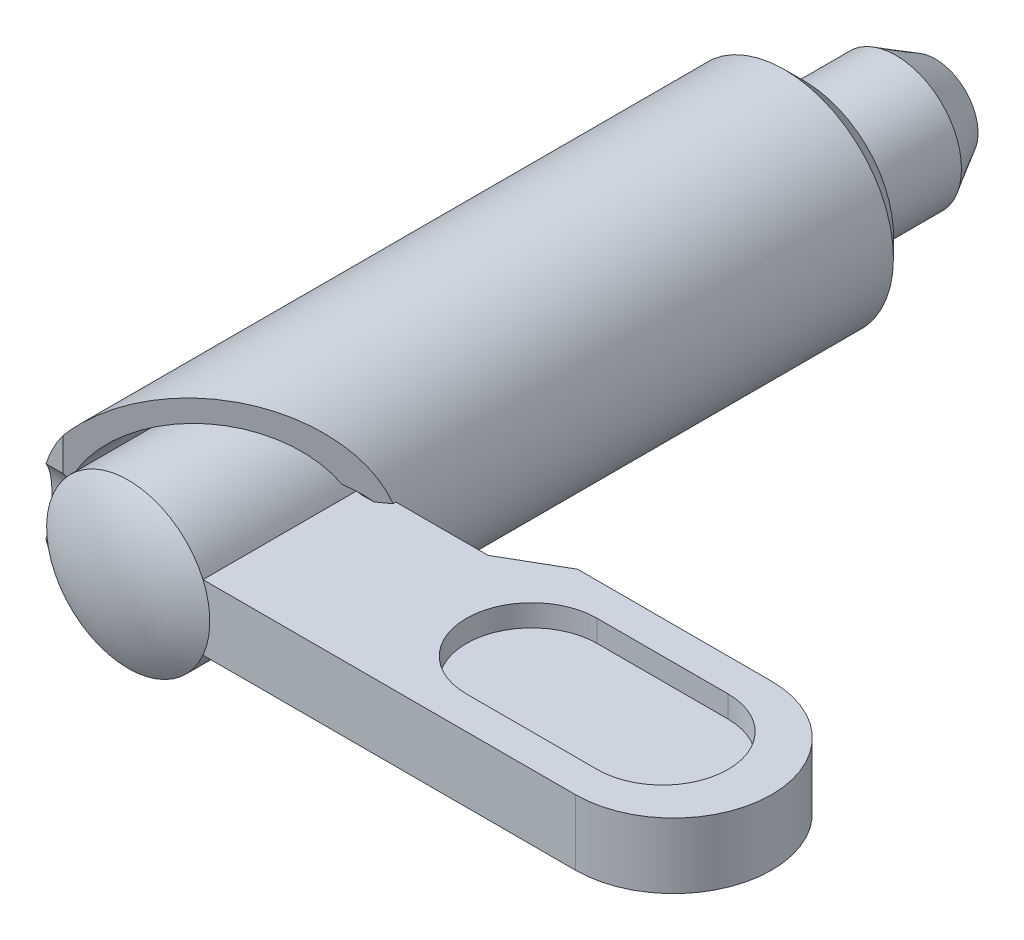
ISO-10303-21;
HEADER;
FILE_DESCRIPTION(('STEP AP214'),'2;1');
FILE_NAME('part.step','',(''),(''),'','','');
FILE_SCHEMA(('AUTOMOTIVE_DESIGN { 1 0 10303 214 1 1 1 1 }'));
ENDSEC;
DATA;
#1=APPLICATION_CONTEXT('core data for automotive mechanical design processes');
#2=APPLICATION_PROTOCOL_DEFINITION('international standard','automotive_design',2000,#1);
#3=PRODUCT_CONTEXT('',#1,'mechanical');
#4=PRODUCT('Part','Part','',(#3));
#5=PRODUCT_RELATED_PRODUCT_CATEGORY('part','',(#4));
#6=PRODUCT_DEFINITION_FORMATION('','',#4);
#7=PRODUCT_DEFINITION_CONTEXT('part definition',#1,'design');
#8=PRODUCT_DEFINITION('design','',#6,#7);
#9=PRODUCT_DEFINITION_SHAPE('','',#8);
#10=(LENGTH_UNIT() NAMED_UNIT(*) SI_UNIT(.MILLI.,.METRE.));
#11=(NAMED_UNIT(*) PLANE_ANGLE_UNIT() SI_UNIT($,.RADIAN.));
#12=(NAMED_UNIT(*) SI_UNIT($,.STERADIAN.) SOLID_ANGLE_UNIT());
#13=UNCERTAINTY_MEASURE_WITH_UNIT(LENGTH_MEASURE(1.E-05),#10,'distance_accuracy_value','');
#14=(GEOMETRIC_REPRESENTATION_CONTEXT(3) GLOBAL_UNCERTAINTY_ASSIGNED_CONTEXT((#13)) GLOBAL_UNIT_ASSIGNED_CONTEXT((#10,
#11,#12)) REPRESENTATION_CONTEXT('',''));
#15=CARTESIAN_POINT('',(0.,0.,0.));
#16=DIRECTION('',(0.,0.,1.));
#17=DIRECTION('',(1.,0.,0.));
#18=AXIS2_PLACEMENT_3D('',#15,#16,#17);
#19=CARTESIAN_POINT('',(-4.,-4.04800210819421,23.));
#20=DIRECTION('',(0.,0.,1.));
#21=DIRECTION('',(1.,0.,0.));
#22=AXIS2_PLACEMENT_3D('',#19,#20,#21);
#23=PLANE('',#22);
#24=CARTESIAN_POINT('',(0.,-1.60608234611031E-13,23.));
#25=DIRECTION('',(0.,0.,1.));
#26=DIRECTION('',(-1.,0.,0.));
#27=AXIS2_PLACEMENT_3D('',#24,#25,#26);
#28=CIRCLE('',#27,4.);
#29=CARTESIAN_POINT('',(-4.,-1.60608234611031E-13,23.));
#30=VERTEX_POINT('',#29);
#31=EDGE_CURVE('E499',#30,#30,#28,.F.);
#32=ORIENTED_EDGE('',*,*,#31,.F.);
#33=EDGE_LOOP('',(#32));
#34=FACE_BOUND('',#33,.T.);
#35=CARTESIAN_POINT('',(0.,-1.60608234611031E-13,23.));
#36=DIRECTION('',(0.,0.,1.));
#37=DIRECTION('',(0.,-1.,0.));
#38=AXIS2_PLACEMENT_3D('',#35,#36,#37);
#39=CIRCLE('',#38,3.74165738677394);
#40=CARTESIAN_POINT('',(0.,-3.7416573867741,23.));
#41=VERTEX_POINT('',#40);
#42=EDGE_CURVE('E186',#41,#41,#39,.F.);
#43=ORIENTED_EDGE('',*,*,#42,.T.);
#44=EDGE_LOOP('',(#43));
#45=FACE_BOUND('',#44,.T.);
#46=ADVANCED_FACE('F14',(#34,#45),#23,.T.);
#47=CARTESIAN_POINT('',(9.,-3.78947509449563,23.5));
#48=DIRECTION('',(0.,0.,-1.));
#49=DIRECTION('',(-1.,0.,0.));
#50=AXIS2_PLACEMENT_3D('',#47,#48,#49);
#51=PLANE('',#50);
#52=DIRECTION('',(-1.,0.,0.));
#53=VECTOR('',#52,1.);
#54=CARTESIAN_POINT('',(2.62917130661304,-1.50000000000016,23.5));
#55=LINE('',#54,#53);
#56=CARTESIAN_POINT('',(3.70809924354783,-1.50000000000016,23.5));
#57=VERTEX_POINT('',#56);
#58=CARTESIAN_POINT('',(3.42782730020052,-1.50000000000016,23.4999999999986));
#59=VERTEX_POINT('',#58);
#60=EDGE_CURVE('E181',#57,#59,#55,.T.);
#61=ORIENTED_EDGE('',*,*,#60,.T.);
#62=CARTESIAN_POINT('',(0.,-1.64099717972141E-13,23.5));
#63=DIRECTION('',(0.,0.,-1.));
#64=DIRECTION('',(0.,1.,0.));
#65=AXIS2_PLACEMENT_3D('',#62,#63,#64);
#66=CIRCLE('',#65,3.74165738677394);
#67=CARTESIAN_POINT('',(3.42782730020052,1.49999999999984,23.5));
#68=VERTEX_POINT('',#67);
#69=EDGE_CURVE('E176',#68,#59,#66,.T.);
#70=ORIENTED_EDGE('',*,*,#69,.F.);
#71=DIRECTION('',(1.,0.,0.));
#72=VECTOR('',#71,1.);
#73=CARTESIAN_POINT('',(2.62917130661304,1.49999999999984,23.5));
#74=LINE('',#73,#72);
#75=CARTESIAN_POINT('',(3.70809924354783,1.49999999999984,23.5));
#76=VERTEX_POINT('',#75);
#77=EDGE_CURVE('E179',#68,#76,#74,.T.);
#78=ORIENTED_EDGE('',*,*,#77,.T.);
#79=CARTESIAN_POINT('',(0.,-1.64099717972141E-13,23.5));
#80=DIRECTION('',(0.,0.,-1.));
#81=DIRECTION('',(0.,1.,0.));
#82=AXIS2_PLACEMENT_3D('',#79,#80,#81);
#83=CIRCLE('',#82,4.);
#84=EDGE_CURVE('E28',#76,#57,#83,.T.);
#85=ORIENTED_EDGE('',*,*,#84,.T.);
#86=EDGE_LOOP('',(#61,#70,#78,#85));
#87=FACE_BOUND('',#86,.T.);
#88=ADVANCED_FACE('F178',(#87),#51,.T.);
#89=CARTESIAN_POINT('',(3.41739827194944,-1.81557134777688E-13,26.));
#90=DIRECTION('',(1.,0.,0.));
#91=DIRECTION('',(0.,0.,1.));
#92=AXIS2_PLACEMENT_3D('',#89,#90,#91);
#93=CYLINDRICAL_SURFACE('',#92,2.5);
#94=CARTESIAN_POINT('',(4.95565591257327,1.49999999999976,24.));
#95=CARTESIAN_POINT('',(4.44637970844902,1.49999999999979,24.));
#96=CARTESIAN_POINT('',(3.93710350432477,1.49999999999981,24.));
#97=CARTESIAN_POINT('',(3.42782730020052,1.49999999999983,24.));
#98=B_SPLINE_CURVE_WITH_KNOTS('',3,(#94,#95,#96,#97),.UNSPECIFIED.,.F.,.F.,(4,4),(0.,
1.52782861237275),.UNSPECIFIED.);
#99=CARTESIAN_POINT('',(4.25829152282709,1.49999999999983,24.));
#100=VERTEX_POINT('',#99);
#101=CARTESIAN_POINT('',(3.70809924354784,1.49999999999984,24.));
#102=VERTEX_POINT('',#101);
#103=EDGE_CURVE('E251',#100,#102,#98,.T.);
#104=ORIENTED_EDGE('',*,*,#103,.F.);
#105=CARTESIAN_POINT('',(1.50552768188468,-1.81557134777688E-13,26.));
#106=DIRECTION('',(0.587785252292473,0.,0.809016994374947));
#107=DIRECTION('',(0.809016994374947,0.,-0.587785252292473));
#108=AXIS2_PLACEMENT_3D('',#105,#106,#107);
#109=ELLIPSE('',#108,4.2532540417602,2.5);
#110=CARTESIAN_POINT('',(3.41757756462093,2.07850032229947,24.6108144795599));
#111=VERTEX_POINT('',#110);
#112=EDGE_CURVE('E529',#111,#100,#109,.F.);
#113=ORIENTED_EDGE('',*,*,#112,.F.);
#114=CARTESIAN_POINT('',(3.41757763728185,-2.07850020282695,24.6108143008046));
#115=CARTESIAN_POINT('',(3.44204013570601,-2.0382822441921,24.5506579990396));
#116=CARTESIAN_POINT('',(3.46702816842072,-1.99559149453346,24.4924201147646));
#117=CARTESIAN_POINT('',(3.51739313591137,-1.90541594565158,24.3799384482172));
#118=CARTESIAN_POINT('',(3.54277015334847,-1.85793011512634,24.3256955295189));
#119=CARTESIAN_POINT('',(3.61878673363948,-1.70791915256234,24.1685878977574));
#120=CARTESIAN_POINT('',(3.66899266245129,-1.59834169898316,24.0720930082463));
#121=CARTESIAN_POINT('',(3.76318752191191,-1.36184369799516,23.8983533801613));
#122=CARTESIAN_POINT('',(3.80715987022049,-1.23487859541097,23.8211595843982));
#123=CARTESIAN_POINT('',(3.86468142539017,-1.03397246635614,23.7226206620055));
#124=CARTESIAN_POINT('',(3.88243252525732,-0.965351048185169,23.6926757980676));
#125=CARTESIAN_POINT('',(3.91465106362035,-0.825036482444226,23.6388648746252));
#126=CARTESIAN_POINT('',(3.92911955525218,-0.753344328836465,23.6149968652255));
#127=CARTESIAN_POINT('',(3.96060532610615,-0.57088733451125,23.5634024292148));
#128=CARTESIAN_POINT('',(3.97527425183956,-0.458524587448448,23.5397232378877));
#129=CARTESIAN_POINT('',(3.99497385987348,-0.230783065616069,23.5080192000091));
#130=CARTESIAN_POINT('',(4.00000365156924,-0.115404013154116,23.4999957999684));
#131=CARTESIAN_POINT('',(3.99999597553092,0.127189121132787,23.5000046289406));
#132=CARTESIAN_POINT('',(3.99387798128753,0.254408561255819,23.509760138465));
#133=CARTESIAN_POINT('',(3.97001485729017,0.50480872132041,23.5482170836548));
#134=CARTESIAN_POINT('',(3.95226550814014,0.627987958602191,23.5769253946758));
#135=CARTESIAN_POINT('',(3.9069277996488,0.866361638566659,23.6516052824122));
#136=CARTESIAN_POINT('',(3.8793850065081,0.981590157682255,23.6974969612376));
#137=CARTESIAN_POINT('',(3.81672324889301,1.20242398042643,23.8047166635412));
#138=CARTESIAN_POINT('',(3.7815982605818,1.30802153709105,23.8660569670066));
#139=CARTESIAN_POINT('',(3.70335012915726,1.51609307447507,24.0078705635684));
#140=CARTESIAN_POINT('',(3.65980996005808,1.61762444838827,24.0894897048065));
#141=CARTESIAN_POINT('',(3.57049238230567,1.8062225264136,24.2667111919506));
#142=CARTESIAN_POINT('',(3.52471811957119,1.89330885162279,24.3622942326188));
#143=CARTESIAN_POINT('',(3.45878963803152,2.00962918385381,24.5117102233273));
#144=CARTESIAN_POINT('',(3.43799469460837,2.04494191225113,24.5606138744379));
#145=CARTESIAN_POINT('',(3.41757754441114,2.07850035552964,24.6108145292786));
#146=B_SPLINE_CURVE_WITH_KNOTS('',3,(#114,#115,#116,#117,#118,#119,#120,#121,#122,#123,#124,
#125,#126,#127,#128,#129,#130,#131,#132,#133,#134,#135,#136,#137,#138,#139,#140,#141,#142,#143,
#144,#145),.UNSPECIFIED.,.F.,.F.,(4,2,2,2,2,2,2,2,2,2,2,2,2,2,2,4),(0.,0.229012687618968,
0.458074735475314,0.919031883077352,1.38119312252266,1.61171006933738,1.84215295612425,
2.18792595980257,2.53373090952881,2.91484961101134,3.29610664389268,3.67561251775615,
4.05542101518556,4.46593333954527,4.87588340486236,5.06713931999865),.UNSPECIFIED.);
#147=EDGE_CURVE('E498',#102,#111,#146,.T.);
#148=ORIENTED_EDGE('',*,*,#147,.F.);
#149=EDGE_LOOP('',(#104,#113,#148));
#150=FACE_BOUND('',#149,.T.);
#151=ADVANCED_FACE('F574',(#150),#93,.F.);
#152=CARTESIAN_POINT('',(-4.,-5.06630126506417,30.));
#153=DIRECTION('',(0.587785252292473,0.,0.809016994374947));
#154=DIRECTION('',(0.809016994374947,0.,-0.587785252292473));
#155=AXIS2_PLACEMENT_3D('',#152,#153,#154);
#156=PLANE('',#155);
#157=CARTESIAN_POINT('',(3.42782730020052,-1.50000000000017,24.6033675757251));
#158=CARTESIAN_POINT('',(3.96988486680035,-1.50000000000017,24.2095397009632));
#159=CARTESIAN_POINT('',(4.51194243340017,-1.50000000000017,23.8157118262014));
#160=CARTESIAN_POINT('',(5.054,-1.50000000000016,23.4218839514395));
#161=B_SPLINE_CURVE_WITH_KNOTS('',3,(#157,#158,#159,#160),.UNSPECIFIED.,.F.,.F.,(4,4),(0.,
2.01006000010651),.UNSPECIFIED.);
#162=CARTESIAN_POINT('',(4.25829152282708,-1.50000000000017,24.));
#163=VERTEX_POINT('',#162);
#164=CARTESIAN_POINT('',(4.76969600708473,-1.50000000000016,23.6284428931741));
#165=VERTEX_POINT('',#164);
#166=EDGE_CURVE('E273',#163,#165,#161,.T.);
#167=ORIENTED_EDGE('',*,*,#166,.F.);
#168=CARTESIAN_POINT('',(3.4175776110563,-2.07850024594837,24.6108143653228));
#169=VERTEX_POINT('',#168);
#170=EDGE_CURVE('E523',#163,#169,#109,.F.);
#171=ORIENTED_EDGE('',*,*,#170,.T.);
#172=CARTESIAN_POINT('',(0.,-1.8919531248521E-13,27.0938298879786));
#173=DIRECTION('',(0.587785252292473,0.,0.809016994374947));
#174=DIRECTION('',(-0.809016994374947,0.,0.587785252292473));
#175=AXIS2_PLACEMENT_3D('',#172,#173,#174);
#176=ELLIPSE('',#175,4.94427190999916,4.);
#177=CARTESIAN_POINT('',(-3.79181860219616,-1.27362166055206,29.8487473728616));
#178=VERTEX_POINT('',#177);
#179=EDGE_CURVE('E463',#169,#178,#176,.F.);
#180=ORIENTED_EDGE('',*,*,#179,.T.);
#181=CARTESIAN_POINT('',(-3.79181856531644,-1.2736215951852,29.8487473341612));
#182=CARTESIAN_POINT('',(-3.79981247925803,-1.28343141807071,29.854555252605));
#183=CARTESIAN_POINT('',(-3.8078680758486,-1.29316433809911,29.8604079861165));
#184=CARTESIAN_POINT('',(-3.82415540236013,-1.31254535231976,29.8722414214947));
#185=CARTESIAN_POINT('',(-3.83238797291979,-1.32219236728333,29.8782227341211));
#186=CARTESIAN_POINT('',(-3.84902922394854,-1.34140157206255,29.8903133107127));
#187=CARTESIAN_POINT('',(-3.85743874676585,-1.35096264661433,29.8964231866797));
#188=CARTESIAN_POINT('',(-3.87443390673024,-1.37000001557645,29.908770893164));
#189=CARTESIAN_POINT('',(-3.88302038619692,-1.37947516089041,29.9150093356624));
#190=CARTESIAN_POINT('',(-3.90036945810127,-1.39834070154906,29.9276141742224));
#191=CARTESIAN_POINT('',(-3.90913289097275,-1.40772991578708,29.9339811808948));
#192=CARTESIAN_POINT('',(-3.92683587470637,-1.42642362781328,29.9468431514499));
#193=CARTESIAN_POINT('',(-3.9357762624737,-1.43572691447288,29.9533387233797));
#194=CARTESIAN_POINT('',(-3.95383315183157,-1.45424879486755,29.9664578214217));
#195=CARTESIAN_POINT('',(-3.96295048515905,-1.46346614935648,29.9730819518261));
#196=CARTESIAN_POINT('',(-3.98136130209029,-1.48181621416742,29.986458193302));
#197=CARTESIAN_POINT('',(-3.99065561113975,-1.49094765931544,29.9932109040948));
#198=CARTESIAN_POINT('',(-4.,-1.50000000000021,30.));
#199=B_SPLINE_CURVE_WITH_KNOTS('',3,(#181,#182,#183,#184,#185,#186,#187,#188,#189,#190,#191,
#192,#193,#194,#195,#196,#197,#198),.UNSPECIFIED.,.F.,.F.,(4,2,2,2,2,2,2,2,4),(0.,
0.0417703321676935,0.0838346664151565,0.126202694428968,0.16888390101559,0.211887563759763,
0.255222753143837,0.298898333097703,0.342922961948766),.UNSPECIFIED.);
#200=CARTESIAN_POINT('',(-4.,-1.50000000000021,30.));
#201=VERTEX_POINT('',#200);
#202=EDGE_CURVE('E550',#178,#201,#199,.T.);
#203=ORIENTED_EDGE('',*,*,#202,.T.);
#204=DIRECTION('',(0.,1.,0.));
#205=VECTOR('',#204,1.);
#206=CARTESIAN_POINT('',(-4.,-5.00000000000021,30.));
#207=LINE('',#206,#205);
#208=CARTESIAN_POINT('',(-4.,-3.00000000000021,30.));
#209=VERTEX_POINT('',#208);
#210=EDGE_CURVE('E543',#201,#209,#207,.F.);
#211=ORIENTED_EDGE('',*,*,#210,.T.);
#212=CARTESIAN_POINT('',(0.,-1.8919531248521E-13,27.0938298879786));
#213=DIRECTION('',(0.587785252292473,0.,0.809016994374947));
#214=DIRECTION('',(-0.809016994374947,0.,0.587785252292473));
#215=AXIS2_PLACEMENT_3D('',#212,#213,#214);
#216=ELLIPSE('',#215,6.18033988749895,5.);
#217=EDGE_CURVE('E526',#165,#209,#216,.F.);
#218=ORIENTED_EDGE('',*,*,#217,.F.);
#219=EDGE_LOOP('',(#167,#171,#180,#203,#211,#218));
#220=FACE_BOUND('',#219,.T.);
#221=ADVANCED_FACE('F265',(#220),#156,.T.);
#222=CARTESIAN_POINT('',(5.054,1.49999999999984,23.4218839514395));
#223=CARTESIAN_POINT('',(4.51194243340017,1.49999999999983,23.8157118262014));
#224=CARTESIAN_POINT('',(3.96988486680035,1.49999999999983,24.2095397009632));
#225=CARTESIAN_POINT('',(3.42782730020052,1.49999999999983,24.6033675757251));
#226=B_SPLINE_CURVE_WITH_KNOTS('',3,(#222,#223,#224,#225),.UNSPECIFIED.,.F.,.F.,(4,4),(0.,
2.01006000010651),.UNSPECIFIED.);
#227=CARTESIAN_POINT('',(4.76969600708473,1.49999999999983,23.6284428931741));
#228=VERTEX_POINT('',#227);
#229=EDGE_CURVE('E243',#228,#100,#226,.T.);
#230=ORIENTED_EDGE('',*,*,#229,.F.);
#231=CARTESIAN_POINT('',(-4.,2.99999999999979,30.));
#232=VERTEX_POINT('',#231);
#233=EDGE_CURVE('E562',#232,#228,#216,.F.);
#234=ORIENTED_EDGE('',*,*,#233,.F.);
#235=DIRECTION('',(0.,1.,0.));
#236=VECTOR('',#235,1.);
#237=CARTESIAN_POINT('',(-4.,-5.00000000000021,30.));
#238=LINE('',#237,#236);
#239=CARTESIAN_POINT('',(-4.,1.49999999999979,30.));
#240=VERTEX_POINT('',#239);
#241=EDGE_CURVE('E461',#232,#240,#238,.F.);
#242=ORIENTED_EDGE('',*,*,#241,.T.);
#243=CARTESIAN_POINT('',(-4.,1.49999999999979,30.));
#244=CARTESIAN_POINT('',(-3.99065561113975,1.49094765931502,29.9932109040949));
#245=CARTESIAN_POINT('',(-3.98136130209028,1.481816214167,29.986458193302));
#246=CARTESIAN_POINT('',(-3.96295048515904,1.46346614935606,29.9730819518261));
#247=CARTESIAN_POINT('',(-3.95383315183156,1.45424879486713,29.9664578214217));
#248=CARTESIAN_POINT('',(-3.93577626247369,1.43572691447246,29.9533387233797));
#249=CARTESIAN_POINT('',(-3.92683587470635,1.42642362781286,29.9468431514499));
#250=CARTESIAN_POINT('',(-3.90913289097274,1.40772991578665,29.9339811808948));
#251=CARTESIAN_POINT('',(-3.90036945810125,1.39834070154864,29.9276141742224));
#252=CARTESIAN_POINT('',(-3.88302038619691,1.37947516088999,29.9150093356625));
#253=CARTESIAN_POINT('',(-3.87443390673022,1.37000001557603,29.9087708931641));
#254=CARTESIAN_POINT('',(-3.85743874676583,1.35096264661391,29.8964231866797));
#255=CARTESIAN_POINT('',(-3.84902922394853,1.34140157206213,29.8903133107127));
#256=CARTESIAN_POINT('',(-3.83238797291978,1.32219236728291,29.8782227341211));
#257=CARTESIAN_POINT('',(-3.82415540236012,1.31254535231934,29.8722414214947));
#258=CARTESIAN_POINT('',(-3.8078680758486,1.29316433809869,29.8604079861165));
#259=CARTESIAN_POINT('',(-3.79981247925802,1.28343141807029,29.854555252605));
#260=CARTESIAN_POINT('',(-3.79181856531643,1.27362159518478,29.8487473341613));
#261=B_SPLINE_CURVE_WITH_KNOTS('',3,(#243,#244,#245,#246,#247,#248,#249,#250,#251,#252,#253,
#254,#255,#256,#257,#258,#259,#260),.UNSPECIFIED.,.F.,.F.,(4,2,2,2,2,2,2,2,4),(0.,
0.0440246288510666,0.0877002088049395,0.131035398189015,0.174039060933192,0.216720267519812,
0.259088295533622,0.301152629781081,0.342922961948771),.UNSPECIFIED.);
#262=CARTESIAN_POINT('',(-3.79181855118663,1.27362163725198,29.8487473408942));
#263=VERTEX_POINT('',#262);
#264=EDGE_CURVE('E532',#240,#263,#261,.T.);
#265=ORIENTED_EDGE('',*,*,#264,.T.);
#266=CARTESIAN_POINT('',(0.,-1.8919531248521E-13,27.0938298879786));
#267=DIRECTION('',(0.587785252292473,0.,0.809016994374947));
#268=DIRECTION('',(-0.809016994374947,0.,0.587785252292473));
#269=AXIS2_PLACEMENT_3D('',#266,#267,#268);
#270=ELLIPSE('',#269,4.94427190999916,4.);
#271=EDGE_CURVE('E483',#263,#111,#270,.F.);
#272=ORIENTED_EDGE('',*,*,#271,.T.);
#273=ORIENTED_EDGE('',*,*,#112,.T.);
#274=EDGE_LOOP('',(#230,#234,#242,#265,#272,#273));
#275=FACE_BOUND('',#274,.T.);
#276=ADVANCED_FACE('F266',(#275),#156,.T.);
#277=CARTESIAN_POINT('',(3.42782730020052,-1.50000000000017,24.));
#278=CARTESIAN_POINT('',(3.93710350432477,-1.50000000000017,24.));
#279=CARTESIAN_POINT('',(4.44637970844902,-1.50000000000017,24.));
#280=CARTESIAN_POINT('',(4.95565591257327,-1.50000000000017,24.));
#281=B_SPLINE_CURVE_WITH_KNOTS('',3,(#277,#278,#279,#280),.UNSPECIFIED.,.F.,.F.,(4,4),(0.,
1.52782861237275),.UNSPECIFIED.);
#282=CARTESIAN_POINT('',(3.70809924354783,-1.50000000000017,24.));
#283=VERTEX_POINT('',#282);
#284=EDGE_CURVE('E280',#283,#163,#281,.T.);
#285=ORIENTED_EDGE('',*,*,#284,.F.);
#286=EDGE_CURVE('E491',#169,#283,#146,.T.);
#287=ORIENTED_EDGE('',*,*,#286,.F.);
#288=ORIENTED_EDGE('',*,*,#170,.F.);
#289=EDGE_LOOP('',(#285,#287,#288));
#290=FACE_BOUND('',#289,.T.);
#291=ADVANCED_FACE('F435',(#290),#93,.F.);
#292=CARTESIAN_POINT('',(0.,-1.60608234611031E-13,23.));
#293=DIRECTION('',(0.,0.,1.));
#294=DIRECTION('',(-1.,0.,0.));
#295=AXIS2_PLACEMENT_3D('',#292,#293,#294);
#296=CYLINDRICAL_SURFACE('',#295,4.);
#297=DIRECTION('',(0.,0.,1.));
#298=VECTOR('',#297,1.);
#299=CARTESIAN_POINT('',(3.70809924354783,-1.50000000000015,22.));
#300=LINE('',#299,#298);
#301=EDGE_CURVE('E868',#57,#283,#300,.T.);
#302=ORIENTED_EDGE('',*,*,#301,.F.);
#303=ORIENTED_EDGE('',*,*,#84,.F.);
#304=DIRECTION('',(0.,0.,1.));
#305=VECTOR('',#304,1.);
#306=CARTESIAN_POINT('',(3.70809924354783,1.49999999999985,22.));
#307=LINE('',#306,#305);
#308=EDGE_CURVE('E195',#102,#76,#307,.F.);
#309=ORIENTED_EDGE('',*,*,#308,.F.);
#310=ORIENTED_EDGE('',*,*,#147,.T.);
#311=ORIENTED_EDGE('',*,*,#271,.F.);
#312=CARTESIAN_POINT('',(-3.79181855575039,-1.2736216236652,29.8487473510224));
#313=CARTESIAN_POINT('',(-3.8095398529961,-1.22088033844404,29.8175186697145));
#314=CARTESIAN_POINT('',(-3.82648052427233,-1.16678047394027,29.7881132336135));
#315=CARTESIAN_POINT('',(-3.85850124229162,-1.05606797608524,29.73316543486));
#316=CARTESIAN_POINT('',(-3.87357976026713,-0.999453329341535,29.7076262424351));
#317=CARTESIAN_POINT('',(-3.90155714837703,-0.883960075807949,29.6606619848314));
#318=CARTESIAN_POINT('',(-3.91445440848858,-0.825079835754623,29.6392399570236));
#319=CARTESIAN_POINT('',(-3.93777055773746,-0.705463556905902,29.6007771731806));
#320=CARTESIAN_POINT('',(-3.94819048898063,-0.644728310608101,29.5837345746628));
#321=CARTESIAN_POINT('',(-3.97122129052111,-0.488422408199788,29.5462420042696));
#322=CARTESIAN_POINT('',(-3.98196601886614,-0.391787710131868,29.5289395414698));
#323=CARTESIAN_POINT('',(-3.99635385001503,-0.196780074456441,29.505822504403));
#324=CARTESIAN_POINT('',(-4.00000558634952,-0.098409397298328,29.4999939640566));
#325=CARTESIAN_POINT('',(-3.99999277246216,0.127320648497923,29.5000078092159));
#326=CARTESIAN_POINT('',(-3.99386362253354,0.254706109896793,29.5097820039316));
#327=CARTESIAN_POINT('',(-3.96991754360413,0.505681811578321,29.5483751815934));
#328=CARTESIAN_POINT('',(-3.95207299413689,0.629262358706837,29.5772391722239));
#329=CARTESIAN_POINT('',(-3.91153904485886,0.841910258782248,29.6440123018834));
#330=CARTESIAN_POINT('',(-3.89083979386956,0.932492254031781,29.6784307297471));
#331=CARTESIAN_POINT('',(-3.84464738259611,1.10766404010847,29.756729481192));
#332=CARTESIAN_POINT('',(-3.81917674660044,1.19227951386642,29.8005654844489));
#333=CARTESIAN_POINT('',(-3.79181855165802,1.27362163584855,29.8487473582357));
#334=B_SPLINE_CURVE_WITH_KNOTS('',3,(#312,#313,#314,#315,#316,#317,#318,#319,#320,#321,#322,
#323,#324,#325,#326,#327,#328,#329,#330,#331,#332,#333),.UNSPECIFIED.,.F.,.F.,(4,2,2,2,2,2,2,2,
2,2,4),(0.,0.191386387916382,0.382928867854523,0.574612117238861,0.766214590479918,
1.06151036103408,1.35644647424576,1.7380305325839,2.12051746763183,2.41704359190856,
2.71220365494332),.UNSPECIFIED.);
#335=EDGE_CURVE('E474',#178,#263,#334,.T.);
#336=ORIENTED_EDGE('',*,*,#335,.F.);
#337=ORIENTED_EDGE('',*,*,#179,.F.);
#338=ORIENTED_EDGE('',*,*,#286,.T.);
#339=EDGE_LOOP('',(#302,#303,#309,#310,#311,#336,#337,#338));
#340=FACE_BOUND('',#339,.T.);
#341=ORIENTED_EDGE('',*,*,#31,.T.);
#342=EDGE_LOOP('',(#341));
#343=FACE_BOUND('',#342,.T.);
#344=ADVANCED_FACE('F486',(#340,#343),#296,.F.);
#345=CARTESIAN_POINT('',(-4.76969600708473,-3.00900000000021,30.));
#346=DIRECTION('',(0.,0.,1.));
#347=DIRECTION('',(1.,0.,0.));
#348=AXIS2_PLACEMENT_3D('',#345,#346,#347);
#349=PLANE('',#348);
#350=CARTESIAN_POINT('',(0.,-2.09489001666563E-13,30.));
#351=DIRECTION('',(0.,0.,1.));
#352=DIRECTION('',(-1.,0.,0.));
#353=AXIS2_PLACEMENT_3D('',#350,#351,#352);
#354=CIRCLE('',#353,5.);
#355=CARTESIAN_POINT('',(-4.76969600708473,-1.5000000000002,30.));
#356=VERTEX_POINT('',#355);
#357=EDGE_CURVE('E484',#209,#356,#354,.F.);
#358=ORIENTED_EDGE('',*,*,#357,.F.);
#359=ORIENTED_EDGE('',*,*,#210,.F.);
#360=DIRECTION('',(1.,0.,0.));
#361=VECTOR('',#360,1.);
#362=CARTESIAN_POINT('',(-4.39590657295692,-1.5000000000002,30.));
#363=LINE('',#362,#361);
#364=EDGE_CURVE('E482',#356,#201,#363,.T.);
#365=ORIENTED_EDGE('',*,*,#364,.F.);
#366=EDGE_LOOP('',(#358,#359,#365));
#367=FACE_BOUND('',#366,.T.);
#368=ADVANCED_FACE('F469',(#367),#349,.T.);
#369=CARTESIAN_POINT('',(-3.79166167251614,-2.23454935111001E-13,32.));
#370=DIRECTION('',(-1.,0.,0.));
#371=DIRECTION('',(0.,0.,-1.));
#372=AXIS2_PLACEMENT_3D('',#369,#370,#371);
#373=CYLINDRICAL_SURFACE('',#372,2.5);
#374=DIRECTION('',(1.,0.,0.));
#375=VECTOR('',#374,1.);
#376=CARTESIAN_POINT('',(-4.38484800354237,1.49999999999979,30.));
#377=LINE('',#376,#375);
#378=CARTESIAN_POINT('',(-4.76969600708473,1.49999999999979,30.));
#379=VERTEX_POINT('',#378);
#380=EDGE_CURVE('E481',#379,#240,#377,.T.);
#381=ORIENTED_EDGE('',*,*,#380,.F.);
#382=CARTESIAN_POINT('',(-4.76969600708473,-1.5000000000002,30.));
#383=CARTESIAN_POINT('',(-4.78628364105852,-1.44725770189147,29.9604486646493));
#384=CARTESIAN_POINT('',(-4.80241993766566,-1.39288339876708,29.9229244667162));
#385=CARTESIAN_POINT('',(-4.83345362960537,-1.28105388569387,29.8521424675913));
#386=CARTESIAN_POINT('',(-4.84835043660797,-1.22359723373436,29.8188866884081));
#387=CARTESIAN_POINT('',(-4.8907237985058,-1.04666316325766,29.7257396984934));
#388=CARTESIAN_POINT('',(-4.91579736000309,-0.92288596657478,29.6726678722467));
#389=CARTESIAN_POINT('',(-4.95685736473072,-0.667928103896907,29.5871516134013));
#390=CARTESIAN_POINT('',(-4.97290389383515,-0.536802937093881,29.5545706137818));
#391=CARTESIAN_POINT('',(-4.99446093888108,-0.270438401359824,29.5110234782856));
#392=CARTESIAN_POINT('',(-4.99999752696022,-0.135210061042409,29.5000038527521));
#393=CARTESIAN_POINT('',(-5.00000240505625,0.131493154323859,29.4999962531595));
#394=CARTESIAN_POINT('',(-4.9947707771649,0.262969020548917,29.5104109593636));
#395=CARTESIAN_POINT('',(-4.97435424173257,0.522235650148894,29.5516285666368));
#396=CARTESIAN_POINT('',(-4.95914613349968,0.650017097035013,29.5824789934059));
#397=CARTESIAN_POINT('',(-4.9294194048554,0.839830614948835,29.6442592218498));
#398=CARTESIAN_POINT('',(-4.91790654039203,0.904656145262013,29.6684002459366));
#399=CARTESIAN_POINT('',(-4.8928123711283,1.03178245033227,29.7218052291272));
#400=CARTESIAN_POINT('',(-4.87923058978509,1.09408263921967,29.7510703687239));
#401=CARTESIAN_POINT('',(-4.85039065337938,1.21556462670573,29.8143462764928));
#402=CARTESIAN_POINT('',(-4.83513749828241,1.27475498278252,29.8483429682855));
#403=CARTESIAN_POINT('',(-4.80331217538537,1.38988155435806,29.9208518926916));
#404=CARTESIAN_POINT('',(-4.78674075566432,1.44581958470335,29.9593615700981));
#405=CARTESIAN_POINT('',(-4.76969600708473,1.49999999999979,30.));
#406=B_SPLINE_CURVE_WITH_KNOTS('',3,(#382,#383,#384,#385,#386,#387,#388,#389,#390,#391,#392,
#393,#394,#395,#396,#397,#398,#399,#400,#401,#402,#403,#404,#405),.UNSPECIFIED.,.F.,.F.,(4,2,2,
2,2,2,2,2,2,2,2,4),(0.,0.203834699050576,0.407765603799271,0.816641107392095,1.22276183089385,
1.62787376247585,2.02184922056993,2.4167441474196,2.62690127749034,2.83710688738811,
3.04669999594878,3.25617500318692),.UNSPECIFIED.);
#407=EDGE_CURVE('E452',#356,#379,#406,.T.);
#408=ORIENTED_EDGE('',*,*,#407,.F.);
#409=ORIENTED_EDGE('',*,*,#364,.T.);
#410=ORIENTED_EDGE('',*,*,#202,.F.);
#411=ORIENTED_EDGE('',*,*,#335,.T.);
#412=ORIENTED_EDGE('',*,*,#264,.F.);
#413=EDGE_LOOP('',(#381,#408,#409,#410,#411,#412));
#414=FACE_BOUND('',#413,.T.);
#415=ADVANCED_FACE('F465',(#414),#373,.F.);
#416=CARTESIAN_POINT('',(-4.76969600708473,1.49999999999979,30.));
#417=DIRECTION('',(0.,0.,1.));
#418=DIRECTION('',(1.,0.,0.));
#419=AXIS2_PLACEMENT_3D('',#416,#417,#418);
#420=PLANE('',#419);
#421=ORIENTED_EDGE('',*,*,#241,.F.);
#422=CARTESIAN_POINT('',(0.,-2.09489001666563E-13,30.));
#423=DIRECTION('',(0.,0.,1.));
#424=DIRECTION('',(-1.,0.,0.));
#425=AXIS2_PLACEMENT_3D('',#422,#423,#424);
#426=CIRCLE('',#425,5.);
#427=EDGE_CURVE('E460',#379,#232,#426,.F.);
#428=ORIENTED_EDGE('',*,*,#427,.F.);
#429=ORIENTED_EDGE('',*,*,#380,.T.);
#430=EDGE_LOOP('',(#421,#428,#429));
#431=FACE_BOUND('',#430,.T.);
#432=ADVANCED_FACE('F263',(#431),#420,.T.);
#433=DIRECTION('',(0.,1.,0.));
#434=VECTOR('',#433,1.);
#435=CARTESIAN_POINT('',(4.94648248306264,-5.06630126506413,23.5));
#436=LINE('',#435,#434);
#437=CARTESIAN_POINT('',(4.94648248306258,-0.729596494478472,23.5));
#438=VERTEX_POINT('',#437);
#439=CARTESIAN_POINT('',(4.94648248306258,0.729596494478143,23.5));
#440=VERTEX_POINT('',#439);
#441=EDGE_CURVE('E202',#438,#440,#436,.T.);
#442=ORIENTED_EDGE('',*,*,#441,.F.);
#443=EDGE_CURVE('E516',#440,#438,#216,.F.);
#444=ORIENTED_EDGE('',*,*,#443,.F.);
#445=EDGE_LOOP('',(#442,#444));
#446=FACE_BOUND('',#445,.T.);
#447=ADVANCED_FACE('F257',(#446),#156,.T.);
#448=CARTESIAN_POINT('',(4.08,-4.12896210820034,0.));
#449=DIRECTION('',(0.,0.,-1.));
#450=DIRECTION('',(-1.,0.,0.));
#451=AXIS2_PLACEMENT_3D('',#448,#449,#450);
#452=PLANE('',#451);
#453=CARTESIAN_POINT('',(0.,0.,0.));
#454=DIRECTION('',(0.,0.,-1.));
#455=DIRECTION('',(0.,1.,0.));
#456=AXIS2_PLACEMENT_3D('',#453,#454,#455);
#457=CIRCLE('',#456,3.);
#458=CARTESIAN_POINT('',(0.,3.,0.));
#459=VERTEX_POINT('',#458);
#460=EDGE_CURVE('E502',#459,#459,#457,.T.);
#461=ORIENTED_EDGE('',*,*,#460,.F.);
#462=EDGE_LOOP('',(#461));
#463=FACE_BOUND('',#462,.T.);
#464=CARTESIAN_POINT('',(0.,0.,0.));
#465=DIRECTION('',(0.,0.,1.));
#466=DIRECTION('',(-1.,0.,0.));
#467=AXIS2_PLACEMENT_3D('',#464,#465,#466);
#468=CIRCLE('',#467,4.08);
#469=CARTESIAN_POINT('',(-4.08,0.,0.));
#470=VERTEX_POINT('',#469);
#471=EDGE_CURVE('E560',#470,#470,#468,.T.);
#472=ORIENTED_EDGE('',*,*,#471,.F.);
#473=EDGE_LOOP('',(#472));
#474=FACE_BOUND('',#473,.T.);
#475=ADVANCED_FACE('F262',(#463,#474),#452,.T.);
#476=CARTESIAN_POINT('',(0.,-2.09489001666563E-13,30.));
#477=DIRECTION('',(0.,0.,1.));
#478=DIRECTION('',(-1.,0.,0.));
#479=AXIS2_PLACEMENT_3D('',#476,#477,#478);
#480=CYLINDRICAL_SURFACE('',#479,5.);
#481=DIRECTION('',(0.,0.,1.));
#482=VECTOR('',#481,1.);
#483=CARTESIAN_POINT('',(4.76969600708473,-1.50000000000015,22.));
#484=LINE('',#483,#482);
#485=CARTESIAN_POINT('',(4.76969600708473,-1.50000000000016,23.5));
#486=VERTEX_POINT('',#485);
#487=EDGE_CURVE('E9',#165,#486,#484,.F.);
#488=ORIENTED_EDGE('',*,*,#487,.F.);
#489=ORIENTED_EDGE('',*,*,#217,.T.);
#490=ORIENTED_EDGE('',*,*,#357,.T.);
#491=ORIENTED_EDGE('',*,*,#407,.T.);
#492=ORIENTED_EDGE('',*,*,#427,.T.);
#493=ORIENTED_EDGE('',*,*,#233,.T.);
#494=DIRECTION('',(0.,0.,1.));
#495=VECTOR('',#494,1.);
#496=CARTESIAN_POINT('',(4.76969600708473,1.49999999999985,22.));
#497=LINE('',#496,#495);
#498=CARTESIAN_POINT('',(4.76969600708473,1.49999999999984,23.5));
#499=VERTEX_POINT('',#498);
#500=EDGE_CURVE('E505',#499,#228,#497,.T.);
#501=ORIENTED_EDGE('',*,*,#500,.F.);
#502=CARTESIAN_POINT('',(0.,-1.64099717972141E-13,23.5));
#503=DIRECTION('',(0.,0.,-1.));
#504=DIRECTION('',(0.,1.,0.));
#505=AXIS2_PLACEMENT_3D('',#502,#503,#504);
#506=CIRCLE('',#505,5.);
#507=EDGE_CURVE('E503',#440,#499,#506,.F.);
#508=ORIENTED_EDGE('',*,*,#507,.F.);
#509=ORIENTED_EDGE('',*,*,#443,.T.);
#510=EDGE_CURVE('E21',#486,#438,#506,.F.);
#511=ORIENTED_EDGE('',*,*,#510,.F.);
#512=EDGE_LOOP('',(#488,#489,#490,#491,#492,#493,#501,#508,#509,#511));
#513=FACE_BOUND('',#512,.T.);
#514=CARTESIAN_POINT('',(0.,0.,0.92000000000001));
#515=DIRECTION('',(0.,0.,-1.));
#516=DIRECTION('',(1.,0.,0.));
#517=AXIS2_PLACEMENT_3D('',#514,#515,#516);
#518=CIRCLE('',#517,5.);
#519=CARTESIAN_POINT('',(5.,0.,0.92000000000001));
#520=VERTEX_POINT('',#519);
#521=EDGE_CURVE('E506',#520,#520,#518,.T.);
#522=ORIENTED_EDGE('',*,*,#521,.F.);
#523=EDGE_LOOP('',(#522));
#524=FACE_BOUND('',#523,.T.);
#525=ADVANCED_FACE('F446',(#513,#524),#480,.T.);
#526=CARTESIAN_POINT('',(0.,0.,0.));
#527=DIRECTION('',(0.,0.,1.));
#528=DIRECTION('',(-1.,0.,0.));
#529=AXIS2_PLACEMENT_3D('',#526,#527,#528);
#530=CONICAL_SURFACE('',#529,4.08,0.785398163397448);
#531=ORIENTED_EDGE('',*,*,#521,.T.);
#532=EDGE_LOOP('',(#531));
#533=FACE_BOUND('',#532,.T.);
#534=ORIENTED_EDGE('',*,*,#471,.T.);
#535=EDGE_LOOP('',(#534));
#536=FACE_BOUND('',#535,.T.);
#537=ADVANCED_FACE('F433',(#533,#536),#530,.T.);
#538=CARTESIAN_POINT('',(10.8788,-0.500000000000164,23.5));
#539=CARTESIAN_POINT('',(11.,-0.500000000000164,23.5));
#540=CARTESIAN_POINT('',(23.,-0.500000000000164,23.5));
#541=CARTESIAN_POINT('',(23.12,-0.500000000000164,23.5));
#542=B_SPLINE_CURVE_WITH_KNOTS('',1,(#538,#539,#540,#541),.UNSPECIFIED.,.F.,.F.,(2,1,1,2),
(-0.0101,0.,1.,1.01),.UNSPECIFIED.);
#543=DIRECTION('',(0.,0.,1.));
#544=VECTOR('',#543,1.);
#545=SURFACE_OF_LINEAR_EXTRUSION('',#542,#544);
#546=DIRECTION('',(1.,0.,0.));
#547=VECTOR('',#546,1.);
#548=CARTESIAN_POINT('',(17.,-0.500000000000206,29.5));
#549=LINE('',#548,#547);
#550=CARTESIAN_POINT('',(14.,-0.500000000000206,29.5));
#551=VERTEX_POINT('',#550);
#552=CARTESIAN_POINT('',(20.,-0.500000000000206,29.5));
#553=VERTEX_POINT('',#552);
#554=EDGE_CURVE('E415',#551,#553,#549,.T.);
#555=ORIENTED_EDGE('',*,*,#554,.F.);
#556=CARTESIAN_POINT('',(14.,-0.500000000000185,26.5));
#557=DIRECTION('',(0.,1.,0.));
#558=DIRECTION('',(0.,0.,1.));
#559=AXIS2_PLACEMENT_3D('',#556,#557,#558);
#560=CIRCLE('',#559,3.);
#561=CARTESIAN_POINT('',(14.,-0.500000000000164,23.5));
#562=VERTEX_POINT('',#561);
#563=EDGE_CURVE('E340',#562,#551,#560,.T.);
#564=ORIENTED_EDGE('',*,*,#563,.F.);
#565=DIRECTION('',(-1.,0.,0.));
#566=VECTOR('',#565,1.);
#567=CARTESIAN_POINT('',(17.,-0.500000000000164,23.5));
#568=LINE('',#567,#566);
#569=CARTESIAN_POINT('',(20.,-0.500000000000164,23.5));
#570=VERTEX_POINT('',#569);
#571=EDGE_CURVE('E344',#570,#562,#568,.T.);
#572=ORIENTED_EDGE('',*,*,#571,.F.);
#573=CARTESIAN_POINT('',(20.,-0.500000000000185,26.5));
#574=DIRECTION('',(0.,1.,0.));
#575=DIRECTION('',(0.,0.,1.));
#576=AXIS2_PLACEMENT_3D('',#573,#574,#575);
#577=CIRCLE('',#576,3.);
#578=EDGE_CURVE('E345',#553,#570,#577,.T.);
#579=ORIENTED_EDGE('',*,*,#578,.F.);
#580=EDGE_LOOP('',(#555,#564,#572,#579));
#581=FACE_BOUND('',#580,.T.);
#582=ADVANCED_FACE('F430',(#581),#545,.T.);
#583=CARTESIAN_POINT('',(0.,-1.71082684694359E-13,24.5));
#584=DIRECTION('',(0.,-1.,0.));
#585=DIRECTION('',(1.,0.,0.));
#586=AXIS2_PLACEMENT_3D('',#583,#584,#585);
#587=SPHERICAL_SURFACE('',#586,7.5);
#588=CARTESIAN_POINT('',(0.,-2.16471968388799E-13,31.0000000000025));
#589=DIRECTION('',(0.,0.,1.));
#590=DIRECTION('',(0.,-1.,0.));
#591=AXIS2_PLACEMENT_3D('',#588,#589,#590);
#592=CIRCLE('',#591,3.74165738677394);
#593=CARTESIAN_POINT('',(3.42782730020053,-1.50000000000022,31.0000000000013));
#594=VERTEX_POINT('',#593);
#595=CARTESIAN_POINT('',(3.42782730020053,1.49999999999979,31.0000000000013));
#596=VERTEX_POINT('',#595);
#597=EDGE_CURVE('E201',#594,#596,#592,.F.);
#598=ORIENTED_EDGE('',*,*,#597,.F.);
#599=CARTESIAN_POINT('',(3.42782730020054,-1.50000000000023,31.));
#600=CARTESIAN_POINT('',(3.47000498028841,-1.40364028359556,31.));
#601=CARTESIAN_POINT('',(3.50809870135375,-1.30549843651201,31.));
#602=CARTESIAN_POINT('',(3.57589326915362,-1.10635930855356,31.));
#603=CARTESIAN_POINT('',(3.60559427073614,-1.00536208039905,31.));
#604=CARTESIAN_POINT('',(3.65638602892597,-0.801193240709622,31.));
#605=CARTESIAN_POINT('',(3.67747474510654,-0.698021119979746,31.));
#606=CARTESIAN_POINT('',(3.710887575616,-0.49029795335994,31.));
#607=CARTESIAN_POINT('',(3.72321206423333,-0.385746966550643,31.));
#608=CARTESIAN_POINT('',(3.74688800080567,-0.0709807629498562,31.));
#609=CARTESIAN_POINT('',(3.74495049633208,0.140382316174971,31.));
#610=CARTESIAN_POINT('',(3.70556982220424,0.55943701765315,31.));
#611=CARTESIAN_POINT('',(3.66818371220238,0.767133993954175,31.));
#612=CARTESIAN_POINT('',(3.58941923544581,1.06061054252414,31.));
#613=CARTESIAN_POINT('',(3.56170810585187,1.15023176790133,31.));
#614=CARTESIAN_POINT('',(3.49968016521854,1.32702391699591,31.));
#615=CARTESIAN_POINT('',(3.46537223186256,1.4141979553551,31.));
#616=CARTESIAN_POINT('',(3.42782730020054,1.49999999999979,31.));
#617=B_SPLINE_CURVE_WITH_KNOTS('',3,(#599,#600,#601,#602,#603,#604,#605,#606,#607,#608,#609,
#610,#611,#612,#613,#614,#615,#616),.UNSPECIFIED.,.F.,.F.,(4,2,2,2,2,2,2,2,4),(0.,
0.315456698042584,0.630907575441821,0.946433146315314,1.26194524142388,1.89286379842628,
2.5227685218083,2.80396781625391,3.08479130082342),.UNSPECIFIED.);
#618=EDGE_CURVE('E367',#594,#596,#617,.T.);
#619=ORIENTED_EDGE('',*,*,#618,.T.);
#620=EDGE_LOOP('',(#598,#619));
#621=FACE_BOUND('',#620,.T.);
#622=ADVANCED_FACE('F230',(#621),#587,.T.);
#623=CARTESIAN_POINT('',(23.12,0.499999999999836,23.5));
#624=CARTESIAN_POINT('',(23.,0.499999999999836,23.5));
#625=CARTESIAN_POINT('',(11.,0.499999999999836,23.5));
#626=CARTESIAN_POINT('',(10.8788,0.499999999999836,23.5));
#627=B_SPLINE_CURVE_WITH_KNOTS('',1,(#623,#624,#625,#626),.UNSPECIFIED.,.F.,.F.,(2,1,1,2),
(-0.01,0.,1.,1.0101),.UNSPECIFIED.);
#628=DIRECTION('',(0.,0.,1.));
#629=VECTOR('',#628,1.);
#630=SURFACE_OF_LINEAR_EXTRUSION('',#627,#629);
#631=DIRECTION('',(1.,0.,0.));
#632=VECTOR('',#631,1.);
#633=CARTESIAN_POINT('',(17.,0.499999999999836,23.5));
#634=LINE('',#633,#632);
#635=CARTESIAN_POINT('',(14.,0.499999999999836,23.5));
#636=VERTEX_POINT('',#635);
#637=CARTESIAN_POINT('',(20.,0.499999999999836,23.5));
#638=VERTEX_POINT('',#637);
#639=EDGE_CURVE('E647',#636,#638,#634,.T.);
#640=ORIENTED_EDGE('',*,*,#639,.F.);
#641=CARTESIAN_POINT('',(14.,0.499999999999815,26.5));
#642=DIRECTION('',(0.,-1.,0.));
#643=DIRECTION('',(0.,0.,-1.));
#644=AXIS2_PLACEMENT_3D('',#641,#642,#643);
#645=CIRCLE('',#644,3.);
#646=CARTESIAN_POINT('',(14.,0.499999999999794,29.5));
#647=VERTEX_POINT('',#646);
#648=EDGE_CURVE('E350',#647,#636,#645,.T.);
#649=ORIENTED_EDGE('',*,*,#648,.F.);
#650=DIRECTION('',(-1.,0.,0.));
#651=VECTOR('',#650,1.);
#652=CARTESIAN_POINT('',(17.,0.499999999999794,29.5));
#653=LINE('',#652,#651);
#654=CARTESIAN_POINT('',(20.,0.499999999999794,29.5));
#655=VERTEX_POINT('',#654);
#656=EDGE_CURVE('E354',#655,#647,#653,.T.);
#657=ORIENTED_EDGE('',*,*,#656,.F.);
#658=CARTESIAN_POINT('',(20.,0.499999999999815,26.5));
#659=DIRECTION('',(0.,-1.,0.));
#660=DIRECTION('',(0.,0.,-1.));
#661=AXIS2_PLACEMENT_3D('',#658,#659,#660);
#662=CIRCLE('',#661,3.);
#663=EDGE_CURVE('E355',#638,#655,#662,.T.);
#664=ORIENTED_EDGE('',*,*,#663,.F.);
#665=EDGE_LOOP('',(#640,#649,#657,#664));
#666=FACE_BOUND('',#665,.T.);
#667=ADVANCED_FACE('F399',(#666),#630,.T.);
#668=CARTESIAN_POINT('',(14.,-1.50000000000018,26.5));
#669=DIRECTION('',(0.,1.,0.));
#670=DIRECTION('',(0.,0.,1.));
#671=AXIS2_PLACEMENT_3D('',#668,#669,#670);
#672=CYLINDRICAL_SURFACE('',#671,3.);
#673=CARTESIAN_POINT('',(14.,-1.50000000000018,26.5));
#674=DIRECTION('',(0.,1.,0.));
#675=DIRECTION('',(0.,0.,1.));
#676=AXIS2_PLACEMENT_3D('',#673,#674,#675);
#677=CIRCLE('',#676,3.);
#678=CARTESIAN_POINT('',(14.,-1.50000000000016,23.5));
#679=VERTEX_POINT('',#678);
#680=CARTESIAN_POINT('',(14.,-1.5000000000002,29.5));
#681=VERTEX_POINT('',#680);
#682=EDGE_CURVE('E311',#679,#681,#677,.T.);
#683=ORIENTED_EDGE('',*,*,#682,.F.);
#684=DIRECTION('',(0.,1.,0.));
#685=VECTOR('',#684,1.);
#686=CARTESIAN_POINT('',(14.,-1.00000000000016,23.5));
#687=LINE('',#686,#685);
#688=EDGE_CURVE('E343',#679,#562,#687,.T.);
#689=ORIENTED_EDGE('',*,*,#688,.T.);
#690=ORIENTED_EDGE('',*,*,#563,.T.);
#691=DIRECTION('',(0.,1.,0.));
#692=VECTOR('',#691,1.);
#693=CARTESIAN_POINT('',(14.,-1.5000000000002,29.5));
#694=LINE('',#693,#692);
#695=EDGE_CURVE('E349',#681,#551,#694,.T.);
#696=ORIENTED_EDGE('',*,*,#695,.F.);
#697=EDGE_LOOP('',(#683,#689,#690,#696));
#698=FACE_BOUND('',#697,.T.);
#699=ADVANCED_FACE('F396',(#698),#672,.F.);
#700=CARTESIAN_POINT('',(14.,-1.50000000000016,23.5));
#701=DIRECTION('',(0.,0.,1.));
#702=DIRECTION('',(1.,0.,0.));
#703=AXIS2_PLACEMENT_3D('',#700,#701,#702);
#704=PLANE('',#703);
#705=DIRECTION('',(-1.,0.,0.));
#706=VECTOR('',#705,1.);
#707=CARTESIAN_POINT('',(14.3217745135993,-1.50000000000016,23.5));
#708=LINE('',#707,#706);
#709=CARTESIAN_POINT('',(20.,-1.50000000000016,23.5));
#710=VERTEX_POINT('',#709);
#711=EDGE_CURVE('E312',#710,#679,#708,.T.);
#712=ORIENTED_EDGE('',*,*,#711,.F.);
#713=DIRECTION('',(0.,-1.,0.));
#714=VECTOR('',#713,1.);
#715=CARTESIAN_POINT('',(20.,-1.00000000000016,23.5));
#716=LINE('',#715,#714);
#717=EDGE_CURVE('E348',#570,#710,#716,.T.);
#718=ORIENTED_EDGE('',*,*,#717,.F.);
#719=ORIENTED_EDGE('',*,*,#571,.T.);
#720=ORIENTED_EDGE('',*,*,#688,.F.);
#721=EDGE_LOOP('',(#712,#718,#719,#720));
#722=FACE_BOUND('',#721,.T.);
#723=ADVANCED_FACE('F390',(#722),#704,.T.);
#724=CARTESIAN_POINT('',(20.,-1.50000000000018,26.5));
#725=DIRECTION('',(0.,1.,0.));
#726=DIRECTION('',(0.,0.,1.));
#727=AXIS2_PLACEMENT_3D('',#724,#725,#726);
#728=CYLINDRICAL_SURFACE('',#727,3.);
#729=CARTESIAN_POINT('',(20.,-1.50000000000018,26.5));
#730=DIRECTION('',(0.,1.,0.));
#731=DIRECTION('',(0.,0.,1.));
#732=AXIS2_PLACEMENT_3D('',#729,#730,#731);
#733=CIRCLE('',#732,3.);
#734=CARTESIAN_POINT('',(20.,-1.5000000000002,29.5));
#735=VERTEX_POINT('',#734);
#736=EDGE_CURVE('E310',#735,#710,#733,.T.);
#737=ORIENTED_EDGE('',*,*,#736,.F.);
#738=DIRECTION('',(0.,1.,0.));
#739=VECTOR('',#738,1.);
#740=CARTESIAN_POINT('',(20.,-1.00000000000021,29.5));
#741=LINE('',#740,#739);
#742=EDGE_CURVE('E639',#735,#553,#741,.T.);
#743=ORIENTED_EDGE('',*,*,#742,.T.);
#744=ORIENTED_EDGE('',*,*,#578,.T.);
#745=ORIENTED_EDGE('',*,*,#717,.T.);
#746=EDGE_LOOP('',(#737,#743,#744,#745));
#747=FACE_BOUND('',#746,.T.);
#748=ADVANCED_FACE('F386',(#747),#728,.F.);
#749=CARTESIAN_POINT('',(20.,-1.5000000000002,29.5));
#750=DIRECTION('',(0.,0.,-1.));
#751=DIRECTION('',(-1.,0.,0.));
#752=AXIS2_PLACEMENT_3D('',#749,#750,#751);
#753=PLANE('',#752);
#754=DIRECTION('',(1.,0.,0.));
#755=VECTOR('',#754,1.);
#756=CARTESIAN_POINT('',(14.3217745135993,-1.5000000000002,29.5));
#757=LINE('',#756,#755);
#758=EDGE_CURVE('E304',#681,#735,#757,.T.);
#759=ORIENTED_EDGE('',*,*,#758,.F.);
#760=ORIENTED_EDGE('',*,*,#695,.T.);
#761=ORIENTED_EDGE('',*,*,#554,.T.);
#762=ORIENTED_EDGE('',*,*,#742,.F.);
#763=EDGE_LOOP('',(#759,#760,#761,#762));
#764=FACE_BOUND('',#763,.T.);
#765=ADVANCED_FACE('F389',(#764),#753,.T.);
#766=CARTESIAN_POINT('',(20.5,-1.50000000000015,22.));
#767=DIRECTION('',(0.,0.,-1.));
#768=DIRECTION('',(-1.,0.,0.));
#769=AXIS2_PLACEMENT_3D('',#766,#767,#768);
#770=PLANE('',#769);
#771=DIRECTION('',(1.,0.,0.));
#772=VECTOR('',#771,1.);
#773=CARTESIAN_POINT('',(14.3217745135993,-1.50000000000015,22.));
#774=LINE('',#773,#772);
#775=CARTESIAN_POINT('',(11.6,-1.50000000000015,22.));
#776=VERTEX_POINT('',#775);
#777=CARTESIAN_POINT('',(20.5,-1.50000000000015,22.));
#778=VERTEX_POINT('',#777);
#779=EDGE_CURVE('E319',#776,#778,#774,.T.);
#780=ORIENTED_EDGE('',*,*,#779,.F.);
#781=DIRECTION('',(0.,1.,0.));
#782=VECTOR('',#781,1.);
#783=CARTESIAN_POINT('',(11.6,-1.50000000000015,22.));
#784=LINE('',#783,#782);
#785=CARTESIAN_POINT('',(11.6,1.49999999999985,22.));
#786=VERTEX_POINT('',#785);
#787=EDGE_CURVE('E324',#786,#776,#784,.F.);
#788=ORIENTED_EDGE('',*,*,#787,.F.);
#789=DIRECTION('',(-1.,0.,0.));
#790=VECTOR('',#789,1.);
#791=CARTESIAN_POINT('',(14.3217745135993,1.49999999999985,22.));
#792=LINE('',#791,#790);
#793=CARTESIAN_POINT('',(20.5,1.49999999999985,22.));
#794=VERTEX_POINT('',#793);
#795=EDGE_CURVE('E665',#794,#786,#792,.T.);
#796=ORIENTED_EDGE('',*,*,#795,.F.);
#797=DIRECTION('',(0.,1.,0.));
#798=VECTOR('',#797,1.);
#799=CARTESIAN_POINT('',(20.5,-1.50000000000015,22.));
#800=LINE('',#799,#798);
#801=EDGE_CURVE('E624',#794,#778,#800,.F.);
#802=ORIENTED_EDGE('',*,*,#801,.T.);
#803=EDGE_LOOP('',(#780,#788,#796,#802));
#804=FACE_BOUND('',#803,.T.);
#805=ADVANCED_FACE('F394',(#804),#770,.T.);
#806=CARTESIAN_POINT('',(20.5,1.49999999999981,26.5));
#807=DIRECTION('',(0.,1.,0.));
#808=DIRECTION('',(0.,0.,1.));
#809=AXIS2_PLACEMENT_3D('',#806,#807,#808);
#810=CYLINDRICAL_SURFACE('',#809,4.5);
#811=CARTESIAN_POINT('',(20.5,-1.50000000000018,26.5));
#812=DIRECTION('',(0.,1.,0.));
#813=DIRECTION('',(0.,0.,1.));
#814=AXIS2_PLACEMENT_3D('',#811,#812,#813);
#815=CIRCLE('',#814,4.5);
#816=CARTESIAN_POINT('',(20.5,-1.50000000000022,31.));
#817=VERTEX_POINT('',#816);
#818=EDGE_CURVE('E318',#778,#817,#815,.F.);
#819=ORIENTED_EDGE('',*,*,#818,.F.);
#820=ORIENTED_EDGE('',*,*,#801,.F.);
#821=CARTESIAN_POINT('',(20.5,1.49999999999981,26.5));
#822=DIRECTION('',(0.,1.,0.));
#823=DIRECTION('',(0.,0.,1.));
#824=AXIS2_PLACEMENT_3D('',#821,#822,#823);
#825=CIRCLE('',#824,4.5);
#826=CARTESIAN_POINT('',(20.5,1.49999999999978,31.));
#827=VERTEX_POINT('',#826);
#828=EDGE_CURVE('E376',#827,#794,#825,.T.);
#829=ORIENTED_EDGE('',*,*,#828,.F.);
#830=DIRECTION('',(0.,-1.,0.));
#831=VECTOR('',#830,1.);
#832=CARTESIAN_POINT('',(20.5,-2.16471968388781E-13,31.));
#833=LINE('',#832,#831);
#834=EDGE_CURVE('E637',#827,#817,#833,.T.);
#835=ORIENTED_EDGE('',*,*,#834,.T.);
#836=EDGE_LOOP('',(#819,#820,#829,#835));
#837=FACE_BOUND('',#836,.T.);
#838=ADVANCED_FACE('F383',(#837),#810,.T.);
#839=CARTESIAN_POINT('',(3.42782730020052,-1.50000000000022,31.));
#840=DIRECTION('',(0.,0.,1.));
#841=DIRECTION('',(1.,0.,0.));
#842=AXIS2_PLACEMENT_3D('',#839,#840,#841);
#843=PLANE('',#842);
#844=ORIENTED_EDGE('',*,*,#834,.F.);
#845=DIRECTION('',(1.,0.,0.));
#846=VECTOR('',#845,1.);
#847=CARTESIAN_POINT('',(14.3217745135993,1.49999999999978,31.));
#848=LINE('',#847,#846);
#849=EDGE_CURVE('E375',#596,#827,#848,.T.);
#850=ORIENTED_EDGE('',*,*,#849,.F.);
#851=ORIENTED_EDGE('',*,*,#618,.F.);
#852=DIRECTION('',(-1.,0.,0.));
#853=VECTOR('',#852,1.);
#854=CARTESIAN_POINT('',(14.3217745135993,-1.50000000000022,31.));
#855=LINE('',#854,#853);
#856=EDGE_CURVE('E315',#817,#594,#855,.T.);
#857=ORIENTED_EDGE('',*,*,#856,.F.);
#858=EDGE_LOOP('',(#844,#850,#851,#857));
#859=FACE_BOUND('',#858,.T.);
#860=ADVANCED_FACE('F378',(#859),#843,.T.);
#861=CARTESIAN_POINT('',(0.,-2.16471968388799E-13,31.0000000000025));
#862=DIRECTION('',(0.,0.,1.));
#863=DIRECTION('',(0.,-1.,0.));
#864=AXIS2_PLACEMENT_3D('',#861,#862,#863);
#865=CYLINDRICAL_SURFACE('',#864,3.74165738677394);
#866=DIRECTION('',(0.,0.,-1.));
#867=VECTOR('',#866,1.);
#868=CARTESIAN_POINT('',(3.42782730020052,1.49999999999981,27.25));
#869=LINE('',#868,#867);
#870=EDGE_CURVE('E193',#596,#68,#869,.T.);
#871=ORIENTED_EDGE('',*,*,#870,.T.);
#872=ORIENTED_EDGE('',*,*,#69,.T.);
#873=DIRECTION('',(0.,0.,1.));
#874=VECTOR('',#873,1.);
#875=CARTESIAN_POINT('',(3.42782730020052,-1.50000000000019,27.25));
#876=LINE('',#875,#874);
#877=EDGE_CURVE('E366',#59,#594,#876,.T.);
#878=ORIENTED_EDGE('',*,*,#877,.T.);
#879=ORIENTED_EDGE('',*,*,#597,.T.);
#880=EDGE_LOOP('',(#871,#872,#878,#879));
#881=FACE_BOUND('',#880,.T.);
#882=ORIENTED_EDGE('',*,*,#42,.F.);
#883=EDGE_LOOP('',(#882));
#884=FACE_BOUND('',#883,.T.);
#885=ADVANCED_FACE('F199',(#881,#884),#865,.T.);
#886=CARTESIAN_POINT('',(14.,1.49999999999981,26.5));
#887=DIRECTION('',(0.,-1.,0.));
#888=DIRECTION('',(0.,0.,-1.));
#889=AXIS2_PLACEMENT_3D('',#886,#887,#888);
#890=CYLINDRICAL_SURFACE('',#889,3.);
#891=CARTESIAN_POINT('',(14.,1.49999999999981,26.5));
#892=DIRECTION('',(0.,-1.,0.));
#893=DIRECTION('',(0.,0.,-1.));
#894=AXIS2_PLACEMENT_3D('',#891,#892,#893);
#895=CIRCLE('',#894,3.);
#896=CARTESIAN_POINT('',(14.,1.49999999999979,29.5));
#897=VERTEX_POINT('',#896);
#898=CARTESIAN_POINT('',(14.,1.49999999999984,23.5));
#899=VERTEX_POINT('',#898);
#900=EDGE_CURVE('E653',#897,#899,#895,.T.);
#901=ORIENTED_EDGE('',*,*,#900,.F.);
#902=DIRECTION('',(0.,-1.,0.));
#903=VECTOR('',#902,1.);
#904=CARTESIAN_POINT('',(14.,0.999999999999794,29.5));
#905=LINE('',#904,#903);
#906=EDGE_CURVE('E353',#897,#647,#905,.T.);
#907=ORIENTED_EDGE('',*,*,#906,.T.);
#908=ORIENTED_EDGE('',*,*,#648,.T.);
#909=DIRECTION('',(0.,-1.,0.));
#910=VECTOR('',#909,1.);
#911=CARTESIAN_POINT('',(14.,1.49999999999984,23.5));
#912=LINE('',#911,#910);
#913=EDGE_CURVE('E359',#899,#636,#912,.T.);
#914=ORIENTED_EDGE('',*,*,#913,.F.);
#915=EDGE_LOOP('',(#901,#907,#908,#914));
#916=FACE_BOUND('',#915,.T.);
#917=ADVANCED_FACE('F596',(#916),#890,.F.);
#918=CARTESIAN_POINT('',(14.,1.49999999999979,29.5));
#919=DIRECTION('',(0.,0.,-1.));
#920=DIRECTION('',(1.,0.,0.));
#921=AXIS2_PLACEMENT_3D('',#918,#919,#920);
#922=PLANE('',#921);
#923=DIRECTION('',(-1.,0.,0.));
#924=VECTOR('',#923,1.);
#925=CARTESIAN_POINT('',(14.3217745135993,1.49999999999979,29.5));
#926=LINE('',#925,#924);
#927=CARTESIAN_POINT('',(20.,1.49999999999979,29.5));
#928=VERTEX_POINT('',#927);
#929=EDGE_CURVE('E657',#928,#897,#926,.T.);
#930=ORIENTED_EDGE('',*,*,#929,.F.);
#931=DIRECTION('',(0.,1.,0.));
#932=VECTOR('',#931,1.);
#933=CARTESIAN_POINT('',(20.,0.999999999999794,29.5));
#934=LINE('',#933,#932);
#935=EDGE_CURVE('E358',#655,#928,#934,.T.);
#936=ORIENTED_EDGE('',*,*,#935,.F.);
#937=ORIENTED_EDGE('',*,*,#656,.T.);
#938=ORIENTED_EDGE('',*,*,#906,.F.);
#939=EDGE_LOOP('',(#930,#936,#937,#938));
#940=FACE_BOUND('',#939,.T.);
#941=ADVANCED_FACE('F601',(#940),#922,.T.);
#942=CARTESIAN_POINT('',(20.,1.49999999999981,26.5));
#943=DIRECTION('',(0.,-1.,0.));
#944=DIRECTION('',(0.,0.,-1.));
#945=AXIS2_PLACEMENT_3D('',#942,#943,#944);
#946=CYLINDRICAL_SURFACE('',#945,3.);
#947=CARTESIAN_POINT('',(20.,1.49999999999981,26.5));
#948=DIRECTION('',(0.,-1.,0.));
#949=DIRECTION('',(0.,0.,-1.));
#950=AXIS2_PLACEMENT_3D('',#947,#948,#949);
#951=CIRCLE('',#950,3.);
#952=CARTESIAN_POINT('',(20.,1.49999999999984,23.5));
#953=VERTEX_POINT('',#952);
#954=EDGE_CURVE('E211',#953,#928,#951,.T.);
#955=ORIENTED_EDGE('',*,*,#954,.F.);
#956=DIRECTION('',(0.,-1.,0.));
#957=VECTOR('',#956,1.);
#958=CARTESIAN_POINT('',(20.,0.999999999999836,23.5));
#959=LINE('',#958,#957);
#960=EDGE_CURVE('E629',#953,#638,#959,.T.);
#961=ORIENTED_EDGE('',*,*,#960,.T.);
#962=ORIENTED_EDGE('',*,*,#663,.T.);
#963=ORIENTED_EDGE('',*,*,#935,.T.);
#964=EDGE_LOOP('',(#955,#961,#962,#963));
#965=FACE_BOUND('',#964,.T.);
#966=ADVANCED_FACE('F608',(#965),#946,.F.);
#967=CARTESIAN_POINT('',(20.,1.49999999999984,23.5));
#968=DIRECTION('',(0.,0.,1.));
#969=DIRECTION('',(-1.,0.,0.));
#970=AXIS2_PLACEMENT_3D('',#967,#968,#969);
#971=PLANE('',#970);
#972=DIRECTION('',(1.,0.,0.));
#973=VECTOR('',#972,1.);
#974=CARTESIAN_POINT('',(14.3217745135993,1.49999999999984,23.5));
#975=LINE('',#974,#973);
#976=EDGE_CURVE('E216',#899,#953,#975,.T.);
#977=ORIENTED_EDGE('',*,*,#976,.F.);
#978=ORIENTED_EDGE('',*,*,#913,.T.);
#979=ORIENTED_EDGE('',*,*,#639,.T.);
#980=ORIENTED_EDGE('',*,*,#960,.F.);
#981=EDGE_LOOP('',(#977,#978,#979,#980));
#982=FACE_BOUND('',#981,.T.);
#983=ADVANCED_FACE('F613',(#982),#971,.T.);
#984=CARTESIAN_POINT('',(11.6,-1.50000000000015,22.));
#985=DIRECTION('',(-0.499722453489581,0.,-0.866185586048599));
#986=DIRECTION('',(-0.866185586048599,0.,0.499722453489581));
#987=AXIS2_PLACEMENT_3D('',#984,#985,#986);
#988=PLANE('',#987);
#989=CARTESIAN_POINT('',(9.00000000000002,-1.50000000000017,23.5));
#990=CARTESIAN_POINT('',(9.10833333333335,-1.50000000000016,23.4375));
#991=CARTESIAN_POINT('',(9.21666666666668,-1.50000000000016,23.375));
#992=CARTESIAN_POINT('',(9.43333333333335,-1.50000000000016,23.25));
#993=CARTESIAN_POINT('',(9.54166666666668,-1.50000000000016,23.1875));
#994=CARTESIAN_POINT('',(9.75833333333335,-1.50000000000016,23.0625));
#995=CARTESIAN_POINT('',(9.86666666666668,-1.50000000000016,23.));
#996=CARTESIAN_POINT('',(10.0833333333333,-1.50000000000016,22.875));
#997=CARTESIAN_POINT('',(10.1916666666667,-1.50000000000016,22.8125));
#998=CARTESIAN_POINT('',(10.4083333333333,-1.50000000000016,22.6875));
#999=CARTESIAN_POINT('',(10.5166666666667,-1.50000000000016,22.625));
#1000=CARTESIAN_POINT('',(10.7333333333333,-1.50000000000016,22.5));
#1001=CARTESIAN_POINT('',(10.8416666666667,-1.50000000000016,22.4375));
#1002=CARTESIAN_POINT('',(11.0583333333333,-1.50000000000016,22.3125));
#1003=CARTESIAN_POINT('',(11.1666666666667,-1.50000000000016,22.25));
#1004=CARTESIAN_POINT('',(11.3833333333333,-1.50000000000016,22.125));
#1005=CARTESIAN_POINT('',(11.4916666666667,-1.50000000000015,22.0625));
#1006=CARTESIAN_POINT('',(11.6,-1.50000000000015,22.));
#1007=B_SPLINE_CURVE_WITH_KNOTS('',3,(#989,#990,#991,#992,#993,#994,#995,#996,#997,#998,#999,
#1000,#1001,#1002,#1003,#1004,#1005,#1006),.UNSPECIFIED.,.F.,.F.,(4,2,2,2,2,2,2,2,4),(0.,
0.375208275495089,0.750416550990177,1.12562482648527,1.50083310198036,1.87604137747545,
2.25124965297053,2.62645792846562,3.00166620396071),.UNSPECIFIED.);
#1008=CARTESIAN_POINT('',(9.,-1.50000000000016,23.5));
#1009=VERTEX_POINT('',#1008);
#1010=EDGE_CURVE('E321',#1009,#776,#1007,.T.);
#1011=ORIENTED_EDGE('',*,*,#1010,.F.);
#1012=DIRECTION('',(0.,1.,0.));
#1013=VECTOR('',#1012,1.);
#1014=CARTESIAN_POINT('',(9.,-3.74165738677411,23.5));
#1015=LINE('',#1014,#1013);
#1016=CARTESIAN_POINT('',(9.,1.49999999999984,23.5));
#1017=VERTEX_POINT('',#1016);
#1018=EDGE_CURVE('E196',#1017,#1009,#1015,.F.);
#1019=ORIENTED_EDGE('',*,*,#1018,.F.);
#1020=CARTESIAN_POINT('',(11.6,1.49999999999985,22.));
#1021=CARTESIAN_POINT('',(11.4916666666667,1.49999999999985,22.0625));
#1022=CARTESIAN_POINT('',(11.3833333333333,1.49999999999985,22.125));
#1023=CARTESIAN_POINT('',(11.1666666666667,1.49999999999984,22.25));
#1024=CARTESIAN_POINT('',(11.0583333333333,1.49999999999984,22.3125));
#1025=CARTESIAN_POINT('',(10.8416666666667,1.49999999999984,22.4375));
#1026=CARTESIAN_POINT('',(10.7333333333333,1.49999999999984,22.5));
#1027=CARTESIAN_POINT('',(10.5166666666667,1.49999999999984,22.625));
#1028=CARTESIAN_POINT('',(10.4083333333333,1.49999999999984,22.6875));
#1029=CARTESIAN_POINT('',(10.1916666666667,1.49999999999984,22.8125));
#1030=CARTESIAN_POINT('',(10.0833333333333,1.49999999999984,22.875));
#1031=CARTESIAN_POINT('',(9.86666666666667,1.49999999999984,23.));
#1032=CARTESIAN_POINT('',(9.75833333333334,1.49999999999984,23.0625));
#1033=CARTESIAN_POINT('',(9.54166666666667,1.49999999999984,23.1875));
#1034=CARTESIAN_POINT('',(9.43333333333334,1.49999999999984,23.25));
#1035=CARTESIAN_POINT('',(9.21666666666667,1.49999999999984,23.375));
#1036=CARTESIAN_POINT('',(9.10833333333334,1.49999999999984,23.4375));
#1037=CARTESIAN_POINT('',(9.00000000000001,1.49999999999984,23.5));
#1038=B_SPLINE_CURVE_WITH_KNOTS('',3,(#1020,#1021,#1022,#1023,#1024,#1025,#1026,#1027,#1028,
#1029,#1030,#1031,#1032,#1033,#1034,#1035,#1036,#1037),.UNSPECIFIED.,.F.,.F.,(4,2,2,2,2,2,2,2,
4),(0.,0.375208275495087,0.750416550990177,1.12562482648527,1.50083310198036,1.87604137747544,
2.25124965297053,2.62645792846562,3.00166620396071),.UNSPECIFIED.);
#1039=EDGE_CURVE('E237',#786,#1017,#1038,.T.);
#1040=ORIENTED_EDGE('',*,*,#1039,.F.);
#1041=ORIENTED_EDGE('',*,*,#787,.T.);
#1042=EDGE_LOOP('',(#1011,#1019,#1040,#1041));
#1043=FACE_BOUND('',#1042,.T.);
#1044=ADVANCED_FACE('F292',(#1043),#988,.T.);
#1045=EDGE_CURVE('E205',#1009,#486,#55,.T.);
#1046=ORIENTED_EDGE('',*,*,#1045,.T.);
#1047=ORIENTED_EDGE('',*,*,#510,.T.);
#1048=ORIENTED_EDGE('',*,*,#441,.T.);
#1049=ORIENTED_EDGE('',*,*,#507,.T.);
#1050=EDGE_CURVE('E197',#499,#1017,#74,.T.);
#1051=ORIENTED_EDGE('',*,*,#1050,.T.);
#1052=ORIENTED_EDGE('',*,*,#1018,.T.);
#1053=EDGE_LOOP('',(#1046,#1047,#1048,#1049,#1051,#1052));
#1054=FACE_BOUND('',#1053,.T.);
#1055=ADVANCED_FACE('F227',(#1054),#51,.T.);
#1056=CARTESIAN_POINT('',(25.215721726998,1.49999999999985,22.));
#1057=CARTESIAN_POINT('',(25.,1.49999999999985,22.));
#1058=CARTESIAN_POINT('',(3.42782730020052,1.49999999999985,22.));
#1059=B_SPLINE_CURVE_WITH_KNOTS('',1,(#1056,#1057,#1058),.UNSPECIFIED.,.F.,.F.,(2,1,2),(-0.01,
0.,1.),.UNSPECIFIED.);
#1060=DIRECTION('',(0.,0.,1.));
#1061=VECTOR('',#1060,1.);
#1062=SURFACE_OF_LINEAR_EXTRUSION('',#1059,#1061);
#1063=ORIENTED_EDGE('',*,*,#976,.T.);
#1064=ORIENTED_EDGE('',*,*,#954,.T.);
#1065=ORIENTED_EDGE('',*,*,#929,.T.);
#1066=ORIENTED_EDGE('',*,*,#900,.T.);
#1067=EDGE_LOOP('',(#1063,#1064,#1065,#1066));
#1068=FACE_BOUND('',#1067,.T.);
#1069=ORIENTED_EDGE('',*,*,#103,.T.);
#1070=ORIENTED_EDGE('',*,*,#308,.T.);
#1071=ORIENTED_EDGE('',*,*,#77,.F.);
#1072=ORIENTED_EDGE('',*,*,#870,.F.);
#1073=ORIENTED_EDGE('',*,*,#849,.T.);
#1074=ORIENTED_EDGE('',*,*,#828,.T.);
#1075=ORIENTED_EDGE('',*,*,#795,.T.);
#1076=ORIENTED_EDGE('',*,*,#1039,.T.);
#1077=ORIENTED_EDGE('',*,*,#1050,.F.);
#1078=ORIENTED_EDGE('',*,*,#500,.T.);
#1079=ORIENTED_EDGE('',*,*,#229,.T.);
#1080=EDGE_LOOP('',(#1069,#1070,#1071,#1072,#1073,#1074,#1075,#1076,#1077,#1078,#1079));
#1081=FACE_BOUND('',#1080,.T.);
#1082=ADVANCED_FACE('F191',(#1068,#1081),#1062,.T.);
#1083=CARTESIAN_POINT('',(3.42782730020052,-1.50000000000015,22.));
#1084=CARTESIAN_POINT('',(25.,-1.50000000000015,22.));
#1085=CARTESIAN_POINT('',(25.215721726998,-1.50000000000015,22.));
#1086=B_SPLINE_CURVE_WITH_KNOTS('',1,(#1083,#1084,#1085),.UNSPECIFIED.,.F.,.F.,(2,1,2),(0.,1.,
1.01),.UNSPECIFIED.);
#1087=DIRECTION('',(0.,0.,1.));
#1088=VECTOR('',#1087,1.);
#1089=SURFACE_OF_LINEAR_EXTRUSION('',#1086,#1088);
#1090=ORIENTED_EDGE('',*,*,#758,.T.);
#1091=ORIENTED_EDGE('',*,*,#736,.T.);
#1092=ORIENTED_EDGE('',*,*,#711,.T.);
#1093=ORIENTED_EDGE('',*,*,#682,.T.);
#1094=EDGE_LOOP('',(#1090,#1091,#1092,#1093));
#1095=FACE_BOUND('',#1094,.T.);
#1096=ORIENTED_EDGE('',*,*,#60,.F.);
#1097=ORIENTED_EDGE('',*,*,#301,.T.);
#1098=ORIENTED_EDGE('',*,*,#284,.T.);
#1099=ORIENTED_EDGE('',*,*,#166,.T.);
#1100=ORIENTED_EDGE('',*,*,#487,.T.);
#1101=ORIENTED_EDGE('',*,*,#1045,.F.);
#1102=ORIENTED_EDGE('',*,*,#1010,.T.);
#1103=ORIENTED_EDGE('',*,*,#779,.T.);
#1104=ORIENTED_EDGE('',*,*,#818,.T.);
#1105=ORIENTED_EDGE('',*,*,#856,.T.);
#1106=ORIENTED_EDGE('',*,*,#877,.F.);
#1107=EDGE_LOOP('',(#1096,#1097,#1098,#1099,#1100,#1101,#1102,#1103,#1104,#1105,#1106));
#1108=FACE_BOUND('',#1107,.T.);
#1109=ADVANCED_FACE('F226',(#1095,#1108),#1089,.T.);
#1110=CARTESIAN_POINT('',(0.,0.,3.00000000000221));
#1111=DIRECTION('',(0.,0.,1.));
#1112=DIRECTION('',(-1.,0.,0.));
#1113=AXIS2_PLACEMENT_3D('',#1110,#1111,#1112);
#1114=CYLINDRICAL_SURFACE('',#1113,3.);
#1115=ORIENTED_EDGE('',*,*,#460,.T.);
#1116=EDGE_LOOP('',(#1115));
#1117=FACE_BOUND('',#1116,.T.);
#1118=CARTESIAN_POINT('',(0.,0.,-4.20000000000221));
#1119=DIRECTION('',(0.,0.,1.));
#1120=DIRECTION('',(1.,0.,0.));
#1121=AXIS2_PLACEMENT_3D('',#1118,#1119,#1120);
#1122=CIRCLE('',#1121,3.);
#1123=CARTESIAN_POINT('',(3.,0.,-4.20000000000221));
#1124=VERTEX_POINT('',#1123);
#1125=EDGE_CURVE('E339',#1124,#1124,#1122,.T.);
#1126=ORIENTED_EDGE('',*,*,#1125,.T.);
#1127=EDGE_LOOP('',(#1126));
#1128=FACE_BOUND('',#1127,.T.);
#1129=ADVANCED_FACE('F290',(#1117,#1128),#1114,.T.);
#1130=CARTESIAN_POINT('',(0.,0.,-6.00000000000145));
#1131=DIRECTION('',(0.,0.,1.));
#1132=DIRECTION('',(-1.,0.,0.));
#1133=AXIS2_PLACEMENT_3D('',#1130,#1131,#1132);
#1134=CONICAL_SURFACE('',#1133,1.96076951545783,0.523598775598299);
#1135=ORIENTED_EDGE('',*,*,#1125,.F.);
#1136=EDGE_LOOP('',(#1135));
#1137=FACE_BOUND('',#1136,.T.);
#1138=CARTESIAN_POINT('',(0.,0.,-6.00000000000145));
#1139=DIRECTION('',(0.,0.,1.));
#1140=DIRECTION('',(-1.,0.,0.));
#1141=AXIS2_PLACEMENT_3D('',#1138,#1139,#1140);
#1142=CIRCLE('',#1141,1.96076951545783);
#1143=CARTESIAN_POINT('',(-1.96076951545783,0.,-6.00000000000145));
#1144=VERTEX_POINT('',#1143);
#1145=EDGE_CURVE('E336',#1144,#1144,#1142,.T.);
#1146=ORIENTED_EDGE('',*,*,#1145,.T.);
#1147=EDGE_LOOP('',(#1146));
#1148=FACE_BOUND('',#1147,.T.);
#1149=ADVANCED_FACE('F436',(#1137,#1148),#1134,.T.);
#1150=CARTESIAN_POINT('',(1.96076951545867,-1.98430085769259,-6.));
#1151=DIRECTION('',(0.,0.,-1.));
#1152=DIRECTION('',(-1.,0.,0.));
#1153=AXIS2_PLACEMENT_3D('',#1150,#1151,#1152);
#1154=PLANE('',#1153);
#1155=ORIENTED_EDGE('',*,*,#1145,.F.);
#1156=EDGE_LOOP('',(#1155));
#1157=FACE_BOUND('',#1156,.T.);
#1158=ADVANCED_FACE('F439',(#1157),#1154,.T.);
#1159=CLOSED_SHELL('',(#46,#88,#151,#221,#276,#291,#344,#368,#415,#432,#447,#475,#525,#537,#582,
#622,#667,#699,#723,#748,#765,#805,#838,#860,#885,#917,#941,#966,#983,#1044,#1055,#1082,#1109,
#1129,#1149,#1158));
#1160=MANIFOLD_SOLID_BREP('B1',#1159);
#1161=ADVANCED_BREP_SHAPE_REPRESENTATION('',(#18,#1160),#14);
#1162=SHAPE_DEFINITION_REPRESENTATION(#9,#1161);
ENDSEC;
END-ISO-10303-21;
